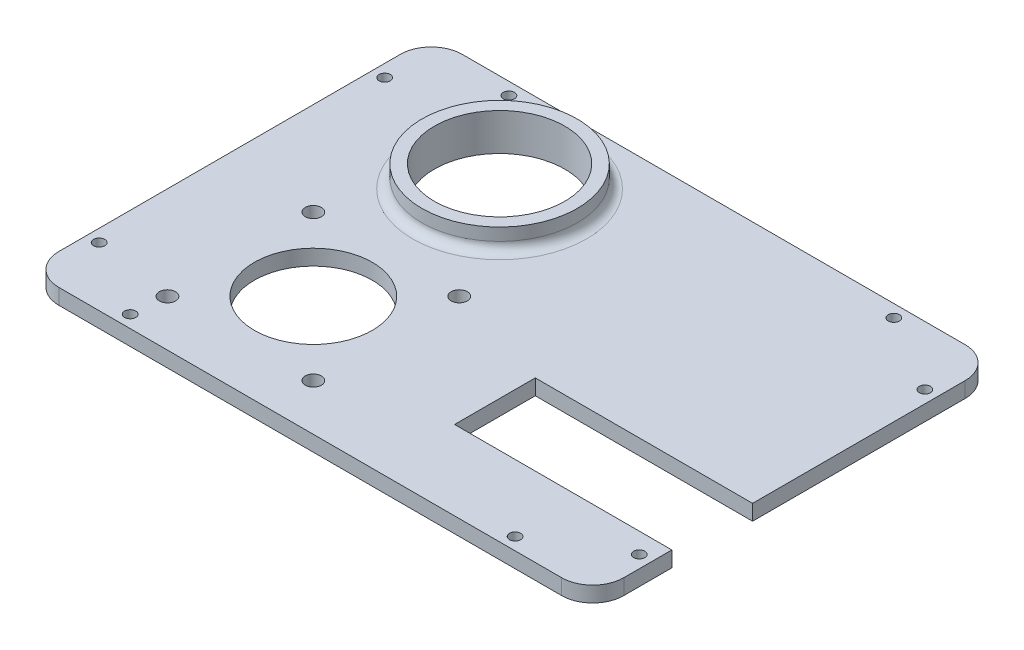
from build123d import *

# Parameters (mm, degrees)
SKETCH1_R           = 2.6
SKETCH1_R_2         = 19
SKETCH1_R_3         = 21
BOSS_EXTRUDE1_DEPTH = 5
SKETCH2_R           = 25
SKETCH2_R_2         = 21
BOSS_EXTRUDE2_DEPTH = 7
FILLET1_R           = 3
SKETCH4_R           = 1.8
CUT_EXTRUDE1_DEPTH  = 158.903451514


with BuildPart() as part:
    # Sketch1 → Boss-Extrude1 (new body)
    with BuildSketch(Plane(origin=(0, 0, 0), x_dir=(1, 0, 0), z_dir=(0, 1, 0))):
        with BuildLine():
            Line((58.5, 13), (128.5, 13))
            Line((128.5, 13), (128.5, 81.5))
            ThreePointArc((128.5, 81.5), (125.571067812, 88.571067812), (118.5, 91.5))
            Line((118.5, 91.5), (-43.5, 91.5))
            ThreePointArc((-43.5, 91.5), (-50.571067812, 88.571067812), (-53.5, 81.5))
            Line((-53.5, 81.5), (-53.5, -28.5))
            ThreePointArc((-53.5, -28.5), (-50.571067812, -35.571067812), (-43.5, -38.5))
            Line((-43.5, -38.5), (118.5, -38.5))
            ThreePointArc((118.5, -38.5), (125.571067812, -35.571067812), (128.5, -28.5))
            Line((128.5, -28.5), (128.5, -13))
            Line((128.5, -13), (58.5, -13))
            Line((58.5, -13), (58.5, 13))
        make_face()
        with Locations(Location((-23.5, -23.5, 0), (0, 0, 270))):
            Circle(SKETCH1_R, mode=Mode.SUBTRACT)
        with Locations(Location((23.5, -23.5, 0), (0, 0, 270))):
            Circle(SKETCH1_R, mode=Mode.SUBTRACT)
        with Locations(Location((-23.5, 23.5, 0), (0, 0, 270))):
            Circle(SKETCH1_R, mode=Mode.SUBTRACT)
        with Locations(Location((0, 0, 0), (0, 0, 270))):
            Circle(SKETCH1_R_2, mode=Mode.SUBTRACT)
        with Locations(Location((23.5, 23.5, 0), (0, 0, 270))):
            Circle(SKETCH1_R, mode=Mode.SUBTRACT)
        with Locations(Location((0, 60, 0), (0, 0, 270))):
            Circle(SKETCH1_R_3, mode=Mode.SUBTRACT)
    extrude(amount=BOSS_EXTRUDE1_DEPTH)

    # Sketch2 → Boss-Extrude2 (add)
    with BuildSketch(Plane(origin=(0, 5, 0), x_dir=(1, 0, 0), z_dir=(0, 1, 0))):
        with Locations(Location((0, 60, 0), (0, 0, 270))):
            Circle(SKETCH2_R)
        with Locations(Location((0, 60, 0), (0, 0, 270))):
            Circle(SKETCH2_R_2, mode=Mode.SUBTRACT)
    extrude(amount=BOSS_EXTRUDE2_DEPTH)

    # Fillet1
    fillet1_edges = [part.edges().sort_by_distance(p)[0] for p in [
        (0, 5, -85),
    ]]
    fillet(fillet1_edges, radius=FILLET1_R)

    # Sketch4 → Cut-Extrude1 (cut, through all)
    with BuildSketch(Plane(origin=(0, 5, 0), x_dir=(1, 0, 0), z_dir=(0, 1, 0))):
        with Locations(Location((-49.5, -19.5, 0), (0, 0, 270))):
            Circle(SKETCH4_R)
        with Locations(Location((-24.5, -34.5, 0), (0, 0, 270))):
            Circle(SKETCH4_R)
        with Locations(Location((-24.5, 87.5, 0), (0, 0, 90))):
            Circle(SKETCH4_R)
        with Locations(Location((-49.5, 72.5, 0), (0, 0, 90))):
            Circle(SKETCH4_R)
        with Locations(Location((99.5, -34.5, 0), (0, 0, 90))):
            Circle(SKETCH4_R)
        with Locations(Location((124.5, -19.5, 0), (0, 0, 90))):
            Circle(SKETCH4_R)
        with Locations(Location((124.5, 72.5, 0), (0, 0, 270))):
            Circle(SKETCH4_R)
        with Locations(Location((99.5, 87.5, 0), (0, 0, 270))):
            Circle(SKETCH4_R)
    extrude(amount=-CUT_EXTRUDE1_DEPTH, mode=Mode.SUBTRACT)


solid = part.part
